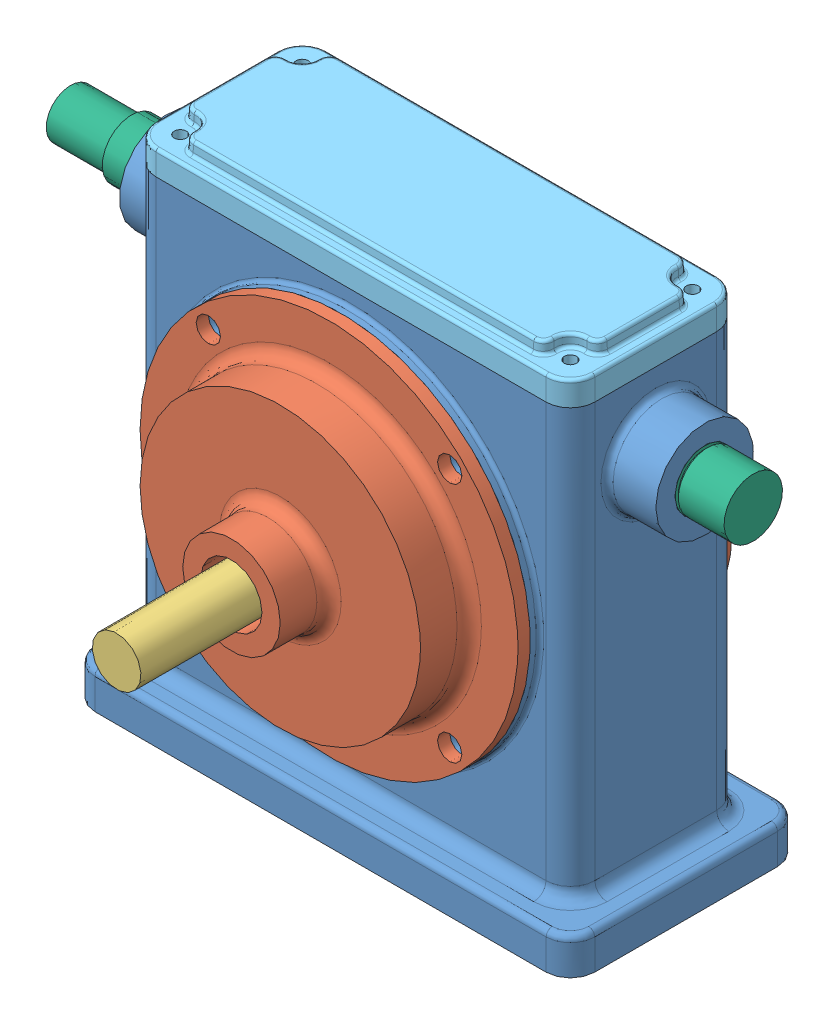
SolidWorks assembly ASSY DRAWINGS.SLDASM, configuration Default (file format 3100). Lengths in mm.
Overall size (177.8 130.18 142.95).
8 component instances, 6 part files, 13 mates.
Components (placement in the parent):
- Housing-1: Housing.SLDPRT [Default] at (100.0125 0 96.8375) size (139.7 120.65 60.32)
- Round Cover Plate-1: Round Cover Plate.SLDPRT [Default] at (100.0125 67.31 121.6025) size (98.42 98.42 28.57)
- Round Cover Plate-2: Round Cover Plate.SLDPRT [Default] at (100.0125 67.31 72.0725) x (-1 0 0) z (0 0 -1) size (98.42 98.42 28.57)
- SubAssy-1: SubAssy.SLDASM [Default] at (100.0125 67.31 43.4975) x (0.995331 0.096522 0) z (0 0 1) size (62.43 62.43 142.95)
  - Worm Gear Shaft-1: Worm Gear Shaft.SLDPRT [Default] at origin size (22.23 22.23 142.95)
  - Worm Gear-1: Worm Gear.SLDPRT [Default] at (0 0 53.34) size (62.43 62.43 25.4)
- Cover Plate-1: Cover Plate.SLDPRT [Default] at (100.0125 120.65 96.8375) size (114.3 9.53 44.45)
- Offset Shaft-1: Offset Shaft.SLDPRT [Default] at (4.7625 101.6 96.8375) x (1 0 0) z (0 -0.190001 -0.981784) size (177.8 15.24 15.24)
Mates (geometry in assembly coordinates):
- Coincident7: coincident anti-aligned: plane of Housing-1 through (100.0125 67.31 121.6025) normal (0 0 1); plane of Round Cover Plate-1
- Concentric1: concentric aligned: cylinder of Housing-1; cylinder of Round Cover Plate-1
- Concentric2: concentric anti-aligned: cylinder of Housing-1; cylinder of Round Cover Plate-1
- Coincident8: coincident anti-aligned: plane of Housing-1 through (100.0125 67.31 72.0725) normal (0 0 -1); plane of Round Cover Plate-2
- Concentric3: concentric aligned: cylinder of Housing-1; cylinder of Round Cover Plate-2
- Concentric4: concentric aligned: cylinder of Housing-1; cylinder of Round Cover Plate-2
- Concentric5: concentric anti-aligned: cylinder of Round Cover Plate-1; cylinder of SubAssy-1/Worm Gear Shaft-1
- Coincident9: coincident anti-aligned: plane of Round Cover Plate-2; plane of SubAssy-1/Worm Gear Shaft-1
- Coincident10: coincident anti-aligned: plane of Housing-1 through (42.8625 120.65 119.0625) normal (0 1 0); plane of Cover Plate-1
- Concentric6: concentric aligned: cylinder of Housing-1; cylinder of Cover Plate-1
- Concentric7: concentric aligned: cylinder of Housing-1; cylinder of Cover Plate-1
- Concentric8: concentric aligned: cylinder of Housing-1; cylinder of Offset Shaft-1
- Coincident11: coincident aligned: unknown of Housing-1
